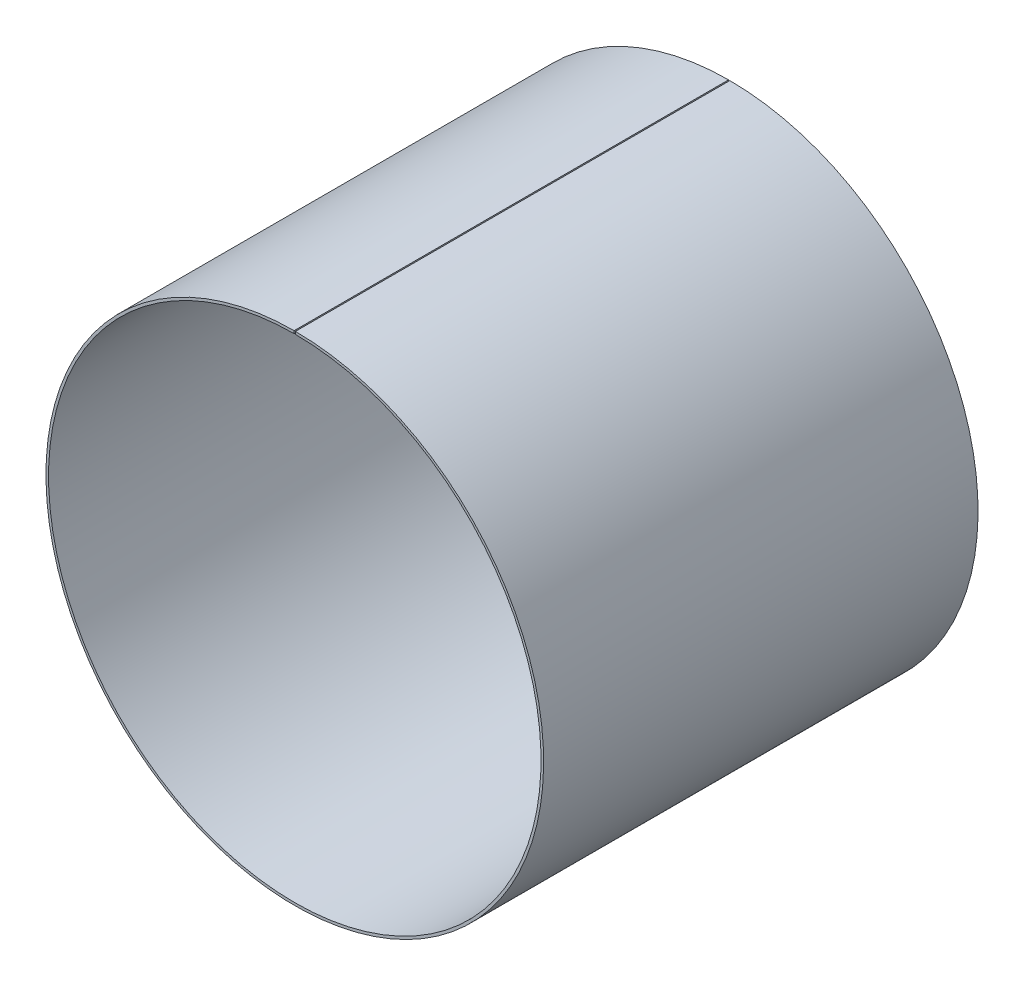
ISO-10303-21;
HEADER;
FILE_DESCRIPTION(('STEP AP214'),'2;1');
FILE_NAME('part.step','',(''),(''),'','','');
FILE_SCHEMA(('AUTOMOTIVE_DESIGN { 1 0 10303 214 1 1 1 1 }'));
ENDSEC;
DATA;
#1=APPLICATION_CONTEXT('core data for automotive mechanical design processes');
#2=APPLICATION_PROTOCOL_DEFINITION('international standard','automotive_design',2000,#1);
#3=PRODUCT_CONTEXT('',#1,'mechanical');
#4=PRODUCT('Part','Part','',(#3));
#5=PRODUCT_RELATED_PRODUCT_CATEGORY('part','',(#4));
#6=PRODUCT_DEFINITION_FORMATION('','',#4);
#7=PRODUCT_DEFINITION_CONTEXT('part definition',#1,'design');
#8=PRODUCT_DEFINITION('design','',#6,#7);
#9=PRODUCT_DEFINITION_SHAPE('','',#8);
#10=(LENGTH_UNIT() NAMED_UNIT(*) SI_UNIT(.MILLI.,.METRE.));
#11=(NAMED_UNIT(*) PLANE_ANGLE_UNIT() SI_UNIT($,.RADIAN.));
#12=(NAMED_UNIT(*) SI_UNIT($,.STERADIAN.) SOLID_ANGLE_UNIT());
#13=UNCERTAINTY_MEASURE_WITH_UNIT(LENGTH_MEASURE(1.E-05),#10,'distance_accuracy_value','');
#14=(GEOMETRIC_REPRESENTATION_CONTEXT(3) GLOBAL_UNCERTAINTY_ASSIGNED_CONTEXT((#13)) GLOBAL_UNIT_ASSIGNED_CONTEXT((#10,
#11,#12)) REPRESENTATION_CONTEXT('',''));
#15=CARTESIAN_POINT('',(0.,0.,0.));
#16=DIRECTION('',(0.,0.,1.));
#17=DIRECTION('',(1.,0.,0.));
#18=AXIS2_PLACEMENT_3D('',#15,#16,#17);
#19=CARTESIAN_POINT('',(1.11022302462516E-13,0.,11.9999998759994));
#20=DIRECTION('',(0.,0.,-1.));
#21=DIRECTION('',(-1.,0.,0.));
#22=AXIS2_PLACEMENT_3D('',#19,#20,#21);
#23=CYLINDRICAL_SURFACE('',#22,152.4);
#24=DIRECTION('',(0.,0.,-1.));
#25=VECTOR('',#24,1.);
#26=CARTESIAN_POINT('',(-0.393700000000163,152.399491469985,11.9999998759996));
#27=LINE('',#26,#25);
#28=CARTESIAN_POINT('',(-0.393699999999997,152.399491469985,4.74979999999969));
#29=VERTEX_POINT('',#28);
#30=CARTESIAN_POINT('',(-0.393700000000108,152.399491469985,-264.123259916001));
#31=VERTEX_POINT('',#30);
#32=EDGE_CURVE('E61',#29,#31,#27,.T.);
#33=ORIENTED_EDGE('',*,*,#32,.F.);
#34=CARTESIAN_POINT('',(0.,0.,4.74979999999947));
#35=DIRECTION('',(0.,0.,-1.));
#36=DIRECTION('',(-1.,0.,0.));
#37=AXIS2_PLACEMENT_3D('',#34,#35,#36);
#38=CIRCLE('',#37,152.4);
#39=CARTESIAN_POINT('',(0.393699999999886,152.399491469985,4.74979999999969));
#40=VERTEX_POINT('',#39);
#41=EDGE_CURVE('E91',#40,#29,#38,.T.);
#42=ORIENTED_EDGE('',*,*,#41,.F.);
#43=DIRECTION('',(0.,0.,-1.));
#44=VECTOR('',#43,1.);
#45=CARTESIAN_POINT('',(0.393699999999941,152.399491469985,11.9999998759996));
#46=LINE('',#45,#44);
#47=CARTESIAN_POINT('',(0.393699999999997,152.399491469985,-264.123259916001));
#48=VERTEX_POINT('',#47);
#49=EDGE_CURVE('E76',#48,#40,#46,.F.);
#50=ORIENTED_EDGE('',*,*,#49,.F.);
#51=CARTESIAN_POINT('',(-1.11022302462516E-13,0.,-264.123259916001));
#52=DIRECTION('',(0.,0.,1.));
#53=DIRECTION('',(1.,0.,0.));
#54=AXIS2_PLACEMENT_3D('',#51,#52,#53);
#55=CIRCLE('',#54,152.4);
#56=EDGE_CURVE('E97',#31,#48,#55,.T.);
#57=ORIENTED_EDGE('',*,*,#56,.F.);
#58=EDGE_LOOP('',(#33,#42,#50,#57));
#59=FACE_BOUND('',#58,.T.);
#60=ADVANCED_FACE('F39',(#59),#23,.F.);
#61=CARTESIAN_POINT('',(0.,-2.22044604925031E-13,-259.373459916));
#62=DIRECTION('',(0.,0.,1.));
#63=DIRECTION('',(1.,0.,0.));
#64=AXIS2_PLACEMENT_3D('',#61,#62,#63);
#65=CYLINDRICAL_SURFACE('',#64,154.);
#66=CARTESIAN_POINT('',(0.,0.,4.74979999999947));
#67=DIRECTION('',(0.,0.,-1.));
#68=DIRECTION('',(-1.,0.,0.));
#69=AXIS2_PLACEMENT_3D('',#66,#67,#68);
#70=CIRCLE('',#69,154.);
#71=CARTESIAN_POINT('',(0.393699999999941,153.999496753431,4.74979999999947));
#72=VERTEX_POINT('',#71);
#73=CARTESIAN_POINT('',(-0.393700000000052,153.999496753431,4.74979999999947));
#74=VERTEX_POINT('',#73);
#75=EDGE_CURVE('E93',#72,#74,#70,.T.);
#76=ORIENTED_EDGE('',*,*,#75,.T.);
#77=DIRECTION('',(0.,0.,1.));
#78=VECTOR('',#77,1.);
#79=CARTESIAN_POINT('',(-0.393699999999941,153.999496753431,-259.373459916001));
#80=LINE('',#79,#78);
#81=CARTESIAN_POINT('',(-0.393700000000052,153.999496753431,-264.123259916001));
#82=VERTEX_POINT('',#81);
#83=EDGE_CURVE('E84',#74,#82,#80,.F.);
#84=ORIENTED_EDGE('',*,*,#83,.T.);
#85=CARTESIAN_POINT('',(-1.11022302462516E-13,0.,-264.123259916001));
#86=DIRECTION('',(0.,0.,1.));
#87=DIRECTION('',(1.,0.,0.));
#88=AXIS2_PLACEMENT_3D('',#85,#86,#87);
#89=CIRCLE('',#88,154.);
#90=CARTESIAN_POINT('',(0.393700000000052,153.999496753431,-264.123259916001));
#91=VERTEX_POINT('',#90);
#92=EDGE_CURVE('E101',#82,#91,#89,.T.);
#93=ORIENTED_EDGE('',*,*,#92,.T.);
#94=DIRECTION('',(0.,0.,1.));
#95=VECTOR('',#94,1.);
#96=CARTESIAN_POINT('',(0.393699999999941,153.999496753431,-259.373459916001));
#97=LINE('',#96,#95);
#98=EDGE_CURVE('E53',#91,#72,#97,.T.);
#99=ORIENTED_EDGE('',*,*,#98,.T.);
#100=EDGE_LOOP('',(#76,#84,#93,#99));
#101=FACE_BOUND('',#100,.T.);
#102=ADVANCED_FACE('F111',(#101),#65,.T.);
#103=CARTESIAN_POINT('',(0.,0.,4.74979999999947));
#104=DIRECTION('',(0.,0.,-1.));
#105=DIRECTION('',(-1.,0.,0.));
#106=AXIS2_PLACEMENT_3D('',#103,#104,#105);
#107=PLANE('',#106);
#108=ORIENTED_EDGE('',*,*,#41,.T.);
#109=DIRECTION('',(0.,-1.,0.));
#110=VECTOR('',#109,1.);
#111=CARTESIAN_POINT('',(-0.393699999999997,161.72510504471,4.74979999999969));
#112=LINE('',#111,#110);
#113=EDGE_CURVE('E94',#74,#29,#112,.T.);
#114=ORIENTED_EDGE('',*,*,#113,.F.);
#115=ORIENTED_EDGE('',*,*,#75,.F.);
#116=DIRECTION('',(0.,1.,0.));
#117=VECTOR('',#116,1.);
#118=CARTESIAN_POINT('',(0.393699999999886,161.72510504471,4.7497999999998));
#119=LINE('',#118,#117);
#120=EDGE_CURVE('E79',#40,#72,#119,.T.);
#121=ORIENTED_EDGE('',*,*,#120,.F.);
#122=EDGE_LOOP('',(#108,#114,#115,#121));
#123=FACE_BOUND('',#122,.T.);
#124=ADVANCED_FACE('F89',(#123),#107,.F.);
#125=CARTESIAN_POINT('',(-1.11022302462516E-13,0.,-264.123259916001));
#126=DIRECTION('',(0.,0.,1.));
#127=DIRECTION('',(1.,0.,0.));
#128=AXIS2_PLACEMENT_3D('',#125,#126,#127);
#129=PLANE('',#128);
#130=ORIENTED_EDGE('',*,*,#92,.F.);
#131=DIRECTION('',(0.,-1.,0.));
#132=VECTOR('',#131,1.);
#133=CARTESIAN_POINT('',(-0.393699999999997,-1.11022302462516E-13,-264.123259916));
#134=LINE('',#133,#132);
#135=EDGE_CURVE('E11',#82,#31,#134,.T.);
#136=ORIENTED_EDGE('',*,*,#135,.T.);
#137=ORIENTED_EDGE('',*,*,#56,.T.);
#138=DIRECTION('',(0.,1.,0.));
#139=VECTOR('',#138,1.);
#140=CARTESIAN_POINT('',(0.393699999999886,0.,-264.123259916));
#141=LINE('',#140,#139);
#142=EDGE_CURVE('E46',#48,#91,#141,.T.);
#143=ORIENTED_EDGE('',*,*,#142,.T.);
#144=EDGE_LOOP('',(#130,#136,#137,#143));
#145=FACE_BOUND('',#144,.T.);
#146=ADVANCED_FACE('F113',(#145),#129,.F.);
#147=CARTESIAN_POINT('',(0.393699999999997,161.72510504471,-264.123259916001));
#148=DIRECTION('',(1.,0.,0.));
#149=DIRECTION('',(0.,1.,0.));
#150=AXIS2_PLACEMENT_3D('',#147,#148,#149);
#151=PLANE('',#150);
#152=ORIENTED_EDGE('',*,*,#49,.T.);
#153=ORIENTED_EDGE('',*,*,#120,.T.);
#154=ORIENTED_EDGE('',*,*,#98,.F.);
#155=ORIENTED_EDGE('',*,*,#142,.F.);
#156=EDGE_LOOP('',(#152,#153,#154,#155));
#157=FACE_BOUND('',#156,.T.);
#158=ADVANCED_FACE('F78',(#157),#151,.F.);
#159=CARTESIAN_POINT('',(-0.393700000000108,161.72510504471,-264.123259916));
#160=DIRECTION('',(-1.,0.,0.));
#161=DIRECTION('',(0.,-1.,0.));
#162=AXIS2_PLACEMENT_3D('',#159,#160,#161);
#163=PLANE('',#162);
#164=ORIENTED_EDGE('',*,*,#32,.T.);
#165=ORIENTED_EDGE('',*,*,#135,.F.);
#166=ORIENTED_EDGE('',*,*,#83,.F.);
#167=ORIENTED_EDGE('',*,*,#113,.T.);
#168=EDGE_LOOP('',(#164,#165,#166,#167));
#169=FACE_BOUND('',#168,.T.);
#170=ADVANCED_FACE('F110',(#169),#163,.F.);
#171=CLOSED_SHELL('',(#60,#102,#124,#146,#158,#170));
#172=MANIFOLD_SOLID_BREP('B2',#171);
#173=ADVANCED_BREP_SHAPE_REPRESENTATION('',(#18,#172),#14);
#174=SHAPE_DEFINITION_REPRESENTATION(#9,#173);
ENDSEC;
END-ISO-10303-21;
